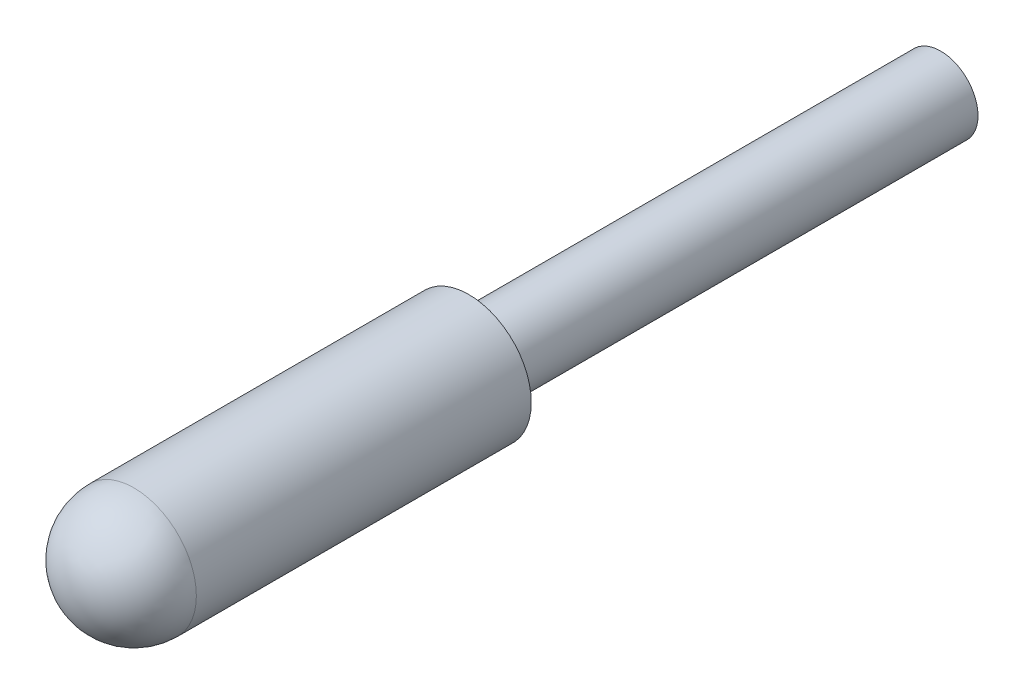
from build123d import *


with BuildPart() as part:
    # Sketch 1 → Revolve 1 (revolve)
    with BuildSketch(Plane(origin=(0, 0, 0), x_dir=(0, 0, -1), z_dir=(1, 0, 0)), mode=Mode.PRIVATE) as revolve_1_sk:
        with BuildLine():
            Line((0, 0), (27.78125, 0))
            Line((27.78125, 0), (27.78125, 1.1938))
            Line((27.78125, 1.1938), (13.096875, 1.1938))
            ThreePointArc((13.096875, 1.1938), (12.816241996, 1.310041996), (12.7, 1.590675))
            Line((12.7, 1.590675), (12.7, 1.9939))
            Line((12.7, 1.9939), (1.9939, 1.9939))
            ThreePointArc((1.9939, 1.9939), (0.583999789, 1.409900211), (0, 0))
        make_face()
    revolve(revolve_1_sk.sketch.rotate(Axis((0, 0, 0), (0, 0, -1)), 90), axis=Axis((0, 0, 0), (0, 0, -1)))


solid = part.part
